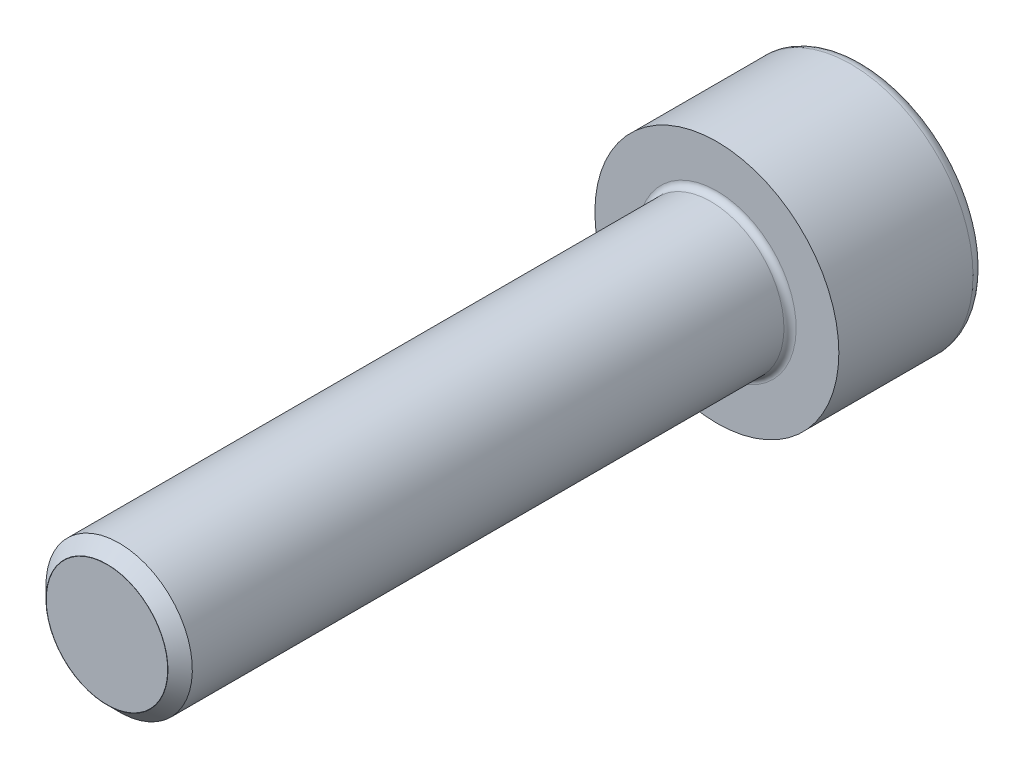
ISO-10303-21;
HEADER;
FILE_DESCRIPTION(('STEP AP214'),'2;1');
FILE_NAME('part.step','',(''),(''),'','','');
FILE_SCHEMA(('AUTOMOTIVE_DESIGN { 1 0 10303 214 1 1 1 1 }'));
ENDSEC;
DATA;
#1=APPLICATION_CONTEXT('core data for automotive mechanical design processes');
#2=APPLICATION_PROTOCOL_DEFINITION('international standard','automotive_design',2000,#1);
#3=PRODUCT_CONTEXT('',#1,'mechanical');
#4=PRODUCT('Part','Part','',(#3));
#5=PRODUCT_RELATED_PRODUCT_CATEGORY('part','',(#4));
#6=PRODUCT_DEFINITION_FORMATION('','',#4);
#7=PRODUCT_DEFINITION_CONTEXT('part definition',#1,'design');
#8=PRODUCT_DEFINITION('design','',#6,#7);
#9=PRODUCT_DEFINITION_SHAPE('','',#8);
#10=(LENGTH_UNIT() NAMED_UNIT(*) SI_UNIT(.MILLI.,.METRE.));
#11=(NAMED_UNIT(*) PLANE_ANGLE_UNIT() SI_UNIT($,.RADIAN.));
#12=(NAMED_UNIT(*) SI_UNIT($,.STERADIAN.) SOLID_ANGLE_UNIT());
#13=UNCERTAINTY_MEASURE_WITH_UNIT(LENGTH_MEASURE(1.E-05),#10,'distance_accuracy_value','');
#14=(GEOMETRIC_REPRESENTATION_CONTEXT(3) GLOBAL_UNCERTAINTY_ASSIGNED_CONTEXT((#13)) GLOBAL_UNIT_ASSIGNED_CONTEXT((#10,
#11,#12)) REPRESENTATION_CONTEXT('',''));
#15=CARTESIAN_POINT('',(0.,0.,0.));
#16=DIRECTION('',(0.,0.,1.));
#17=DIRECTION('',(1.,0.,0.));
#18=AXIS2_PLACEMENT_3D('',#15,#16,#17);
#19=CARTESIAN_POINT('',(0.,2.49,25.));
#20=DIRECTION('',(0.,0.,1.));
#21=DIRECTION('',(0.,-1.,0.));
#22=AXIS2_PLACEMENT_3D('',#19,#20,#21);
#23=PLANE('',#22);
#24=CARTESIAN_POINT('',(0.,0.,25.));
#25=DIRECTION('',(0.,0.,-1.));
#26=DIRECTION('',(0.,1.,0.));
#27=AXIS2_PLACEMENT_3D('',#24,#25,#26);
#28=CIRCLE('',#27,2.49);
#29=CARTESIAN_POINT('',(0.,2.49,25.));
#30=VERTEX_POINT('',#29);
#31=EDGE_CURVE('E137',#30,#30,#28,.T.);
#32=ORIENTED_EDGE('',*,*,#31,.F.);
#33=EDGE_LOOP('',(#32));
#34=FACE_BOUND('',#33,.T.);
#35=ADVANCED_FACE('F36',(#34),#23,.T.);
#36=CARTESIAN_POINT('',(0.,0.,-6.));
#37=DIRECTION('',(0.,0.,-1.));
#38=DIRECTION('',(0.,1.,0.));
#39=AXIS2_PLACEMENT_3D('',#36,#37,#38);
#40=PLANE('',#39);
#41=DIRECTION('',(-1.,0.,0.));
#42=VECTOR('',#41,1.);
#43=CARTESIAN_POINT('',(1.44337567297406,-2.5,-6.));
#44=LINE('',#43,#42);
#45=CARTESIAN_POINT('',(1.44337567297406,-2.5,-6.));
#46=VERTEX_POINT('',#45);
#47=CARTESIAN_POINT('',(-1.44337567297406,-2.5,-6.));
#48=VERTEX_POINT('',#47);
#49=EDGE_CURVE('E50',#46,#48,#44,.T.);
#50=ORIENTED_EDGE('',*,*,#49,.F.);
#51=DIRECTION('',(-0.5,-0.866025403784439,0.));
#52=VECTOR('',#51,1.);
#53=CARTESIAN_POINT('',(2.88675134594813,0.,-6.));
#54=LINE('',#53,#52);
#55=CARTESIAN_POINT('',(2.88675134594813,0.,-6.));
#56=VERTEX_POINT('',#55);
#57=EDGE_CURVE('E133',#56,#46,#54,.T.);
#58=ORIENTED_EDGE('',*,*,#57,.F.);
#59=DIRECTION('',(0.5,-0.866025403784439,0.));
#60=VECTOR('',#59,1.);
#61=CARTESIAN_POINT('',(1.44337567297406,2.5,-6.));
#62=LINE('',#61,#60);
#63=CARTESIAN_POINT('',(1.44337567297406,2.5,-6.));
#64=VERTEX_POINT('',#63);
#65=EDGE_CURVE('E131',#64,#56,#62,.T.);
#66=ORIENTED_EDGE('',*,*,#65,.F.);
#67=DIRECTION('',(1.,0.,0.));
#68=VECTOR('',#67,1.);
#69=CARTESIAN_POINT('',(-1.44337567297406,2.5,-6.));
#70=LINE('',#69,#68);
#71=CARTESIAN_POINT('',(-1.44337567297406,2.5,-6.));
#72=VERTEX_POINT('',#71);
#73=EDGE_CURVE('E98',#72,#64,#70,.T.);
#74=ORIENTED_EDGE('',*,*,#73,.F.);
#75=DIRECTION('',(0.5,0.866025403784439,0.));
#76=VECTOR('',#75,1.);
#77=CARTESIAN_POINT('',(-2.88675134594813,0.,-6.));
#78=LINE('',#77,#76);
#79=CARTESIAN_POINT('',(-2.88675134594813,0.,-6.));
#80=VERTEX_POINT('',#79);
#81=EDGE_CURVE('E127',#80,#72,#78,.T.);
#82=ORIENTED_EDGE('',*,*,#81,.F.);
#83=DIRECTION('',(-0.5,0.866025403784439,0.));
#84=VECTOR('',#83,1.);
#85=CARTESIAN_POINT('',(-1.44337567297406,-2.5,-6.));
#86=LINE('',#85,#84);
#87=EDGE_CURVE('E124',#48,#80,#86,.T.);
#88=ORIENTED_EDGE('',*,*,#87,.F.);
#89=EDGE_LOOP('',(#50,#58,#66,#74,#82,#88));
#90=FACE_BOUND('',#89,.T.);
#91=CARTESIAN_POINT('',(0.,0.,-6.));
#92=DIRECTION('',(0.,0.,-1.));
#93=DIRECTION('',(0.,1.,0.));
#94=AXIS2_PLACEMENT_3D('',#91,#92,#93);
#95=CIRCLE('',#94,4.49999999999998);
#96=CARTESIAN_POINT('',(0.,4.5,-6.));
#97=VERTEX_POINT('',#96);
#98=EDGE_CURVE('E11',#97,#97,#95,.T.);
#99=ORIENTED_EDGE('',*,*,#98,.T.);
#100=EDGE_LOOP('',(#99));
#101=FACE_BOUND('',#100,.T.);
#102=ADVANCED_FACE('F189',(#90,#101),#40,.T.);
#103=CARTESIAN_POINT('',(0.,0.,-5.5));
#104=DIRECTION('',(0.,0.,-1.));
#105=DIRECTION('',(0.,1.,0.));
#106=AXIS2_PLACEMENT_3D('',#103,#104,#105);
#107=TOROIDAL_SURFACE('',#106,4.49999999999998,0.5);
#108=CARTESIAN_POINT('',(0.,0.,-5.5));
#109=DIRECTION('',(0.,0.,-1.));
#110=DIRECTION('',(0.,1.,0.));
#111=AXIS2_PLACEMENT_3D('',#108,#109,#110);
#112=CIRCLE('',#111,4.99999999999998);
#113=CARTESIAN_POINT('',(0.,5.,-5.5));
#114=VERTEX_POINT('',#113);
#115=EDGE_CURVE('E43',#114,#114,#112,.T.);
#116=ORIENTED_EDGE('',*,*,#115,.T.);
#117=EDGE_LOOP('',(#116));
#118=FACE_BOUND('',#117,.T.);
#119=ORIENTED_EDGE('',*,*,#98,.F.);
#120=EDGE_LOOP('',(#119));
#121=FACE_BOUND('',#120,.T.);
#122=ADVANCED_FACE('F174',(#118,#121),#107,.T.);
#123=CARTESIAN_POINT('',(0.,0.,25.));
#124=DIRECTION('',(0.,0.,-1.));
#125=DIRECTION('',(0.,1.,0.));
#126=AXIS2_PLACEMENT_3D('',#123,#124,#125);
#127=CYLINDRICAL_SURFACE('',#126,4.99999999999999);
#128=CARTESIAN_POINT('',(0.,0.,0.));
#129=DIRECTION('',(0.,0.,-1.));
#130=DIRECTION('',(0.,1.,0.));
#131=AXIS2_PLACEMENT_3D('',#128,#129,#130);
#132=CIRCLE('',#131,4.99999999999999);
#133=CARTESIAN_POINT('',(0.,5.,0.));
#134=VERTEX_POINT('',#133);
#135=EDGE_CURVE('E169',#134,#134,#132,.T.);
#136=ORIENTED_EDGE('',*,*,#135,.T.);
#137=EDGE_LOOP('',(#136));
#138=FACE_BOUND('',#137,.T.);
#139=ORIENTED_EDGE('',*,*,#115,.F.);
#140=EDGE_LOOP('',(#139));
#141=FACE_BOUND('',#140,.T.);
#142=ADVANCED_FACE('F177',(#138,#141),#127,.T.);
#143=CARTESIAN_POINT('',(0.,5.,0.));
#144=DIRECTION('',(0.,0.,1.));
#145=DIRECTION('',(0.,-1.,0.));
#146=AXIS2_PLACEMENT_3D('',#143,#144,#145);
#147=PLANE('',#146);
#148=CARTESIAN_POINT('',(0.,0.,0.));
#149=DIRECTION('',(0.,0.,-1.));
#150=DIRECTION('',(0.,1.,0.));
#151=AXIS2_PLACEMENT_3D('',#148,#149,#150);
#152=CIRCLE('',#151,3.24999999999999);
#153=CARTESIAN_POINT('',(0.,3.25,0.));
#154=VERTEX_POINT('',#153);
#155=EDGE_CURVE('E166',#154,#154,#152,.T.);
#156=ORIENTED_EDGE('',*,*,#155,.T.);
#157=EDGE_LOOP('',(#156));
#158=FACE_BOUND('',#157,.T.);
#159=ORIENTED_EDGE('',*,*,#135,.F.);
#160=EDGE_LOOP('',(#159));
#161=FACE_BOUND('',#160,.T.);
#162=ADVANCED_FACE('F179',(#158,#161),#147,.T.);
#163=CARTESIAN_POINT('',(0.,0.,0.249999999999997));
#164=DIRECTION('',(0.,0.,-1.));
#165=DIRECTION('',(0.,1.,0.));
#166=AXIS2_PLACEMENT_3D('',#163,#164,#165);
#167=TOROIDAL_SURFACE('',#166,3.24999999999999,0.25);
#168=CARTESIAN_POINT('',(0.,0.,0.25));
#169=DIRECTION('',(0.,0.,-1.));
#170=DIRECTION('',(0.,1.,0.));
#171=AXIS2_PLACEMENT_3D('',#168,#169,#170);
#172=CIRCLE('',#171,2.99999999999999);
#173=CARTESIAN_POINT('',(0.,3.,0.250000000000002));
#174=VERTEX_POINT('',#173);
#175=EDGE_CURVE('E163',#174,#174,#172,.T.);
#176=ORIENTED_EDGE('',*,*,#175,.T.);
#177=EDGE_LOOP('',(#176));
#178=FACE_BOUND('',#177,.T.);
#179=ORIENTED_EDGE('',*,*,#155,.F.);
#180=EDGE_LOOP('',(#179));
#181=FACE_BOUND('',#180,.T.);
#182=ADVANCED_FACE('F186',(#178,#181),#167,.F.);
#183=CARTESIAN_POINT('',(0.,0.,25.));
#184=DIRECTION('',(0.,0.,-1.));
#185=DIRECTION('',(0.,1.,0.));
#186=AXIS2_PLACEMENT_3D('',#183,#184,#185);
#187=CYLINDRICAL_SURFACE('',#186,2.99999999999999);
#188=CARTESIAN_POINT('',(0.,0.,24.5));
#189=DIRECTION('',(0.,0.,-1.));
#190=DIRECTION('',(0.,1.,0.));
#191=AXIS2_PLACEMENT_3D('',#188,#189,#190);
#192=CIRCLE('',#191,3.);
#193=CARTESIAN_POINT('',(0.,3.,24.5));
#194=VERTEX_POINT('',#193);
#195=EDGE_CURVE('E160',#194,#194,#192,.T.);
#196=ORIENTED_EDGE('',*,*,#195,.T.);
#197=EDGE_LOOP('',(#196));
#198=FACE_BOUND('',#197,.T.);
#199=ORIENTED_EDGE('',*,*,#175,.F.);
#200=EDGE_LOOP('',(#199));
#201=FACE_BOUND('',#200,.T.);
#202=ADVANCED_FACE('F233',(#198,#201),#187,.T.);
#203=CARTESIAN_POINT('',(0.,0.,24.5));
#204=DIRECTION('',(0.,0.,-1.));
#205=DIRECTION('',(0.,1.,0.));
#206=AXIS2_PLACEMENT_3D('',#203,#204,#205);
#207=CONICAL_SURFACE('',#206,3.,0.78539816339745);
#208=CARTESIAN_POINT('',(0.,0.,25.));
#209=DIRECTION('',(0.,0.,-1.));
#210=DIRECTION('',(0.,1.,0.));
#211=AXIS2_PLACEMENT_3D('',#208,#209,#210);
#212=CIRCLE('',#211,2.5);
#213=CARTESIAN_POINT('',(0.,2.5,25.));
#214=VERTEX_POINT('',#213);
#215=EDGE_CURVE('E157',#214,#214,#212,.T.);
#216=ORIENTED_EDGE('',*,*,#215,.T.);
#217=EDGE_LOOP('',(#216));
#218=FACE_BOUND('',#217,.T.);
#219=ORIENTED_EDGE('',*,*,#195,.F.);
#220=EDGE_LOOP('',(#219));
#221=FACE_BOUND('',#220,.T.);
#222=ADVANCED_FACE('F227',(#218,#221),#207,.T.);
#223=CARTESIAN_POINT('',(0.,0.,25.));
#224=DIRECTION('',(0.,0.,-1.));
#225=DIRECTION('',(0.,1.,0.));
#226=AXIS2_PLACEMENT_3D('',#223,#224,#225);
#227=CYLINDRICAL_SURFACE('',#226,2.49999999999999);
#228=CARTESIAN_POINT('',(0.,0.,3.));
#229=DIRECTION('',(0.,0.,-1.));
#230=DIRECTION('',(0.,1.,0.));
#231=AXIS2_PLACEMENT_3D('',#228,#229,#230);
#232=CIRCLE('',#231,2.49999999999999);
#233=CARTESIAN_POINT('',(0.,2.5,3.));
#234=VERTEX_POINT('',#233);
#235=EDGE_CURVE('E154',#234,#234,#232,.T.);
#236=ORIENTED_EDGE('',*,*,#235,.T.);
#237=EDGE_LOOP('',(#236));
#238=FACE_BOUND('',#237,.T.);
#239=ORIENTED_EDGE('',*,*,#215,.F.);
#240=EDGE_LOOP('',(#239));
#241=FACE_BOUND('',#240,.T.);
#242=ADVANCED_FACE('F221',(#238,#241),#227,.F.);
#243=CARTESIAN_POINT('',(0.,0.,3.));
#244=DIRECTION('',(0.,0.,-1.));
#245=DIRECTION('',(0.,1.,0.));
#246=AXIS2_PLACEMENT_3D('',#243,#244,#245);
#247=CONICAL_SURFACE('',#246,2.49999999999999,0.785398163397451);
#248=CARTESIAN_POINT('',(0.,0.,2.51000000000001));
#249=DIRECTION('',(0.,0.,-1.));
#250=DIRECTION('',(0.,1.,0.));
#251=AXIS2_PLACEMENT_3D('',#248,#249,#250);
#252=CIRCLE('',#251,2.98999999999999);
#253=CARTESIAN_POINT('',(0.,2.99,2.51000000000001));
#254=VERTEX_POINT('',#253);
#255=EDGE_CURVE('E151',#254,#254,#252,.T.);
#256=ORIENTED_EDGE('',*,*,#255,.T.);
#257=EDGE_LOOP('',(#256));
#258=FACE_BOUND('',#257,.T.);
#259=ORIENTED_EDGE('',*,*,#235,.F.);
#260=EDGE_LOOP('',(#259));
#261=FACE_BOUND('',#260,.T.);
#262=ADVANCED_FACE('F215',(#258,#261),#247,.F.);
#263=CARTESIAN_POINT('',(0.,0.,25.));
#264=DIRECTION('',(0.,0.,-1.));
#265=DIRECTION('',(0.,1.,0.));
#266=AXIS2_PLACEMENT_3D('',#263,#264,#265);
#267=CYLINDRICAL_SURFACE('',#266,2.98999999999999);
#268=CARTESIAN_POINT('',(0.,0.,2.50000000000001));
#269=DIRECTION('',(0.,0.,-1.));
#270=DIRECTION('',(0.,1.,0.));
#271=AXIS2_PLACEMENT_3D('',#268,#269,#270);
#272=CIRCLE('',#271,2.98999999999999);
#273=CARTESIAN_POINT('',(0.,2.99,2.50000000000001));
#274=VERTEX_POINT('',#273);
#275=EDGE_CURVE('E148',#274,#274,#272,.T.);
#276=ORIENTED_EDGE('',*,*,#275,.T.);
#277=EDGE_LOOP('',(#276));
#278=FACE_BOUND('',#277,.T.);
#279=ORIENTED_EDGE('',*,*,#255,.F.);
#280=EDGE_LOOP('',(#279));
#281=FACE_BOUND('',#280,.T.);
#282=ADVANCED_FACE('F209',(#278,#281),#267,.F.);
#283=CARTESIAN_POINT('',(0.,0.,2.50000000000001));
#284=DIRECTION('',(0.,0.,-1.));
#285=DIRECTION('',(0.,1.,0.));
#286=AXIS2_PLACEMENT_3D('',#283,#284,#285);
#287=CONICAL_SURFACE('',#286,2.98999999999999,0.785398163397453);
#288=CARTESIAN_POINT('',(0.,0.,2.99999999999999));
#289=DIRECTION('',(0.,0.,-1.));
#290=DIRECTION('',(0.,1.,0.));
#291=AXIS2_PLACEMENT_3D('',#288,#289,#290);
#292=CIRCLE('',#291,2.49);
#293=CARTESIAN_POINT('',(0.,2.49000000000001,2.99999999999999));
#294=VERTEX_POINT('',#293);
#295=EDGE_CURVE('E145',#294,#294,#292,.T.);
#296=ORIENTED_EDGE('',*,*,#295,.T.);
#297=EDGE_LOOP('',(#296));
#298=FACE_BOUND('',#297,.T.);
#299=ORIENTED_EDGE('',*,*,#275,.F.);
#300=EDGE_LOOP('',(#299));
#301=FACE_BOUND('',#300,.T.);
#302=ADVANCED_FACE('F203',(#298,#301),#287,.T.);
#303=CARTESIAN_POINT('',(0.,0.,25.));
#304=DIRECTION('',(0.,0.,-1.));
#305=DIRECTION('',(0.,1.,0.));
#306=AXIS2_PLACEMENT_3D('',#303,#304,#305);
#307=CYLINDRICAL_SURFACE('',#306,2.49);
#308=ORIENTED_EDGE('',*,*,#31,.T.);
#309=EDGE_LOOP('',(#308));
#310=FACE_BOUND('',#309,.T.);
#311=ORIENTED_EDGE('',*,*,#295,.F.);
#312=EDGE_LOOP('',(#311));
#313=FACE_BOUND('',#312,.T.);
#314=ADVANCED_FACE('F199',(#310,#313),#307,.T.);
#315=CARTESIAN_POINT('',(1.44337567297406,-2.5,-3.));
#316=DIRECTION('',(0.,-1.,0.));
#317=DIRECTION('',(1.,0.,0.));
#318=AXIS2_PLACEMENT_3D('',#315,#316,#317);
#319=PLANE('',#318);
#320=ORIENTED_EDGE('',*,*,#49,.T.);
#321=DIRECTION('',(0.,0.,-1.));
#322=VECTOR('',#321,1.);
#323=CARTESIAN_POINT('',(-1.44337567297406,-2.5,-3.));
#324=LINE('',#323,#322);
#325=CARTESIAN_POINT('',(-1.44337567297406,-2.5,-3.));
#326=VERTEX_POINT('',#325);
#327=EDGE_CURVE('E80',#326,#48,#324,.T.);
#328=ORIENTED_EDGE('',*,*,#327,.F.);
#329=DIRECTION('',(-1.,0.,0.));
#330=VECTOR('',#329,1.);
#331=CARTESIAN_POINT('',(1.44337567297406,-2.5,-3.));
#332=LINE('',#331,#330);
#333=CARTESIAN_POINT('',(1.44337567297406,-2.5,-3.));
#334=VERTEX_POINT('',#333);
#335=EDGE_CURVE('E135',#334,#326,#332,.T.);
#336=ORIENTED_EDGE('',*,*,#335,.F.);
#337=DIRECTION('',(0.,0.,-1.));
#338=VECTOR('',#337,1.);
#339=CARTESIAN_POINT('',(1.44337567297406,-2.5,-3.));
#340=LINE('',#339,#338);
#341=EDGE_CURVE('E58',#334,#46,#340,.T.);
#342=ORIENTED_EDGE('',*,*,#341,.T.);
#343=EDGE_LOOP('',(#320,#328,#336,#342));
#344=FACE_BOUND('',#343,.T.);
#345=ADVANCED_FACE('F202',(#344),#319,.F.);
#346=CARTESIAN_POINT('',(2.88675134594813,0.,-3.));
#347=DIRECTION('',(0.866025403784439,-0.5,0.));
#348=DIRECTION('',(0.5,0.866025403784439,0.));
#349=AXIS2_PLACEMENT_3D('',#346,#347,#348);
#350=PLANE('',#349);
#351=ORIENTED_EDGE('',*,*,#57,.T.);
#352=ORIENTED_EDGE('',*,*,#341,.F.);
#353=DIRECTION('',(-0.5,-0.866025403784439,0.));
#354=VECTOR('',#353,1.);
#355=CARTESIAN_POINT('',(2.88675134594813,0.,-3.));
#356=LINE('',#355,#354);
#357=CARTESIAN_POINT('',(2.88675134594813,0.,-3.));
#358=VERTEX_POINT('',#357);
#359=EDGE_CURVE('E110',#358,#334,#356,.T.);
#360=ORIENTED_EDGE('',*,*,#359,.F.);
#361=DIRECTION('',(0.,0.,-1.));
#362=VECTOR('',#361,1.);
#363=CARTESIAN_POINT('',(2.88675134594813,0.,-3.));
#364=LINE('',#363,#362);
#365=EDGE_CURVE('E102',#358,#56,#364,.T.);
#366=ORIENTED_EDGE('',*,*,#365,.T.);
#367=EDGE_LOOP('',(#351,#352,#360,#366));
#368=FACE_BOUND('',#367,.T.);
#369=ADVANCED_FACE('F253',(#368),#350,.F.);
#370=CARTESIAN_POINT('',(1.44337567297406,2.5,-3.));
#371=DIRECTION('',(0.866025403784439,0.5,0.));
#372=DIRECTION('',(-0.5,0.866025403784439,0.));
#373=AXIS2_PLACEMENT_3D('',#370,#371,#372);
#374=PLANE('',#373);
#375=ORIENTED_EDGE('',*,*,#65,.T.);
#376=ORIENTED_EDGE('',*,*,#365,.F.);
#377=DIRECTION('',(0.5,-0.866025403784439,0.));
#378=VECTOR('',#377,1.);
#379=CARTESIAN_POINT('',(1.44337567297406,2.5,-3.));
#380=LINE('',#379,#378);
#381=CARTESIAN_POINT('',(1.44337567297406,2.5,-3.));
#382=VERTEX_POINT('',#381);
#383=EDGE_CURVE('E106',#382,#358,#380,.T.);
#384=ORIENTED_EDGE('',*,*,#383,.F.);
#385=DIRECTION('',(0.,0.,-1.));
#386=VECTOR('',#385,1.);
#387=CARTESIAN_POINT('',(1.44337567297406,2.5,-3.));
#388=LINE('',#387,#386);
#389=EDGE_CURVE('E91',#382,#64,#388,.T.);
#390=ORIENTED_EDGE('',*,*,#389,.T.);
#391=EDGE_LOOP('',(#375,#376,#384,#390));
#392=FACE_BOUND('',#391,.T.);
#393=ADVANCED_FACE('F107',(#392),#374,.F.);
#394=CARTESIAN_POINT('',(-1.44337567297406,2.5,-3.));
#395=DIRECTION('',(0.,1.,0.));
#396=DIRECTION('',(0.,0.,1.));
#397=AXIS2_PLACEMENT_3D('',#394,#395,#396);
#398=PLANE('',#397);
#399=ORIENTED_EDGE('',*,*,#73,.T.);
#400=ORIENTED_EDGE('',*,*,#389,.F.);
#401=DIRECTION('',(1.,0.,0.));
#402=VECTOR('',#401,1.);
#403=CARTESIAN_POINT('',(-1.44337567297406,2.5,-3.));
#404=LINE('',#403,#402);
#405=CARTESIAN_POINT('',(-1.44337567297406,2.5,-3.));
#406=VERTEX_POINT('',#405);
#407=EDGE_CURVE('E95',#406,#382,#404,.T.);
#408=ORIENTED_EDGE('',*,*,#407,.F.);
#409=DIRECTION('',(0.,0.,-1.));
#410=VECTOR('',#409,1.);
#411=CARTESIAN_POINT('',(-1.44337567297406,2.5,-3.));
#412=LINE('',#411,#410);
#413=EDGE_CURVE('E103',#406,#72,#412,.T.);
#414=ORIENTED_EDGE('',*,*,#413,.T.);
#415=EDGE_LOOP('',(#399,#400,#408,#414));
#416=FACE_BOUND('',#415,.T.);
#417=ADVANCED_FACE('F93',(#416),#398,.F.);
#418=CARTESIAN_POINT('',(-2.88675134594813,0.,-3.));
#419=DIRECTION('',(-0.866025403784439,0.5,0.));
#420=DIRECTION('',(-0.5,-0.866025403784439,0.));
#421=AXIS2_PLACEMENT_3D('',#418,#419,#420);
#422=PLANE('',#421);
#423=ORIENTED_EDGE('',*,*,#81,.T.);
#424=ORIENTED_EDGE('',*,*,#413,.F.);
#425=DIRECTION('',(0.5,0.866025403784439,0.));
#426=VECTOR('',#425,1.);
#427=CARTESIAN_POINT('',(-2.88675134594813,0.,-3.));
#428=LINE('',#427,#426);
#429=CARTESIAN_POINT('',(-2.88675134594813,0.,-3.));
#430=VERTEX_POINT('',#429);
#431=EDGE_CURVE('E116',#430,#406,#428,.T.);
#432=ORIENTED_EDGE('',*,*,#431,.F.);
#433=DIRECTION('',(0.,0.,-1.));
#434=VECTOR('',#433,1.);
#435=CARTESIAN_POINT('',(-2.88675134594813,0.,-3.));
#436=LINE('',#435,#434);
#437=EDGE_CURVE('E140',#430,#80,#436,.T.);
#438=ORIENTED_EDGE('',*,*,#437,.T.);
#439=EDGE_LOOP('',(#423,#424,#432,#438));
#440=FACE_BOUND('',#439,.T.);
#441=ADVANCED_FACE('F257',(#440),#422,.F.);
#442=CARTESIAN_POINT('',(-1.44337567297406,-2.5,-3.));
#443=DIRECTION('',(-0.866025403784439,-0.5,0.));
#444=DIRECTION('',(0.5,-0.866025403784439,0.));
#445=AXIS2_PLACEMENT_3D('',#442,#443,#444);
#446=PLANE('',#445);
#447=ORIENTED_EDGE('',*,*,#87,.T.);
#448=ORIENTED_EDGE('',*,*,#437,.F.);
#449=DIRECTION('',(-0.5,0.866025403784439,0.));
#450=VECTOR('',#449,1.);
#451=CARTESIAN_POINT('',(-1.44337567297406,-2.5,-3.));
#452=LINE('',#451,#450);
#453=EDGE_CURVE('E118',#326,#430,#452,.T.);
#454=ORIENTED_EDGE('',*,*,#453,.F.);
#455=ORIENTED_EDGE('',*,*,#327,.T.);
#456=EDGE_LOOP('',(#447,#448,#454,#455));
#457=FACE_BOUND('',#456,.T.);
#458=ADVANCED_FACE('F254',(#457),#446,.F.);
#459=CARTESIAN_POINT('',(0.,0.,-3.));
#460=DIRECTION('',(0.,0.,-1.));
#461=DIRECTION('',(-1.,0.,0.));
#462=AXIS2_PLACEMENT_3D('',#459,#460,#461);
#463=PLANE('',#462);
#464=ORIENTED_EDGE('',*,*,#335,.T.);
#465=ORIENTED_EDGE('',*,*,#453,.T.);
#466=ORIENTED_EDGE('',*,*,#431,.T.);
#467=ORIENTED_EDGE('',*,*,#407,.T.);
#468=ORIENTED_EDGE('',*,*,#383,.T.);
#469=ORIENTED_EDGE('',*,*,#359,.T.);
#470=EDGE_LOOP('',(#464,#465,#466,#467,#468,#469));
#471=FACE_BOUND('',#470,.T.);
#472=ADVANCED_FACE('F113',(#471),#463,.T.);
#473=CLOSED_SHELL('',(#35,#102,#122,#142,#162,#182,#202,#222,#242,#262,#282,#302,#314,#345,#369,
#393,#417,#441,#458,#472));
#474=MANIFOLD_SOLID_BREP('B2',#473);
#475=ADVANCED_BREP_SHAPE_REPRESENTATION('',(#18,#474),#14);
#476=SHAPE_DEFINITION_REPRESENTATION(#9,#475);
ENDSEC;
END-ISO-10303-21;
